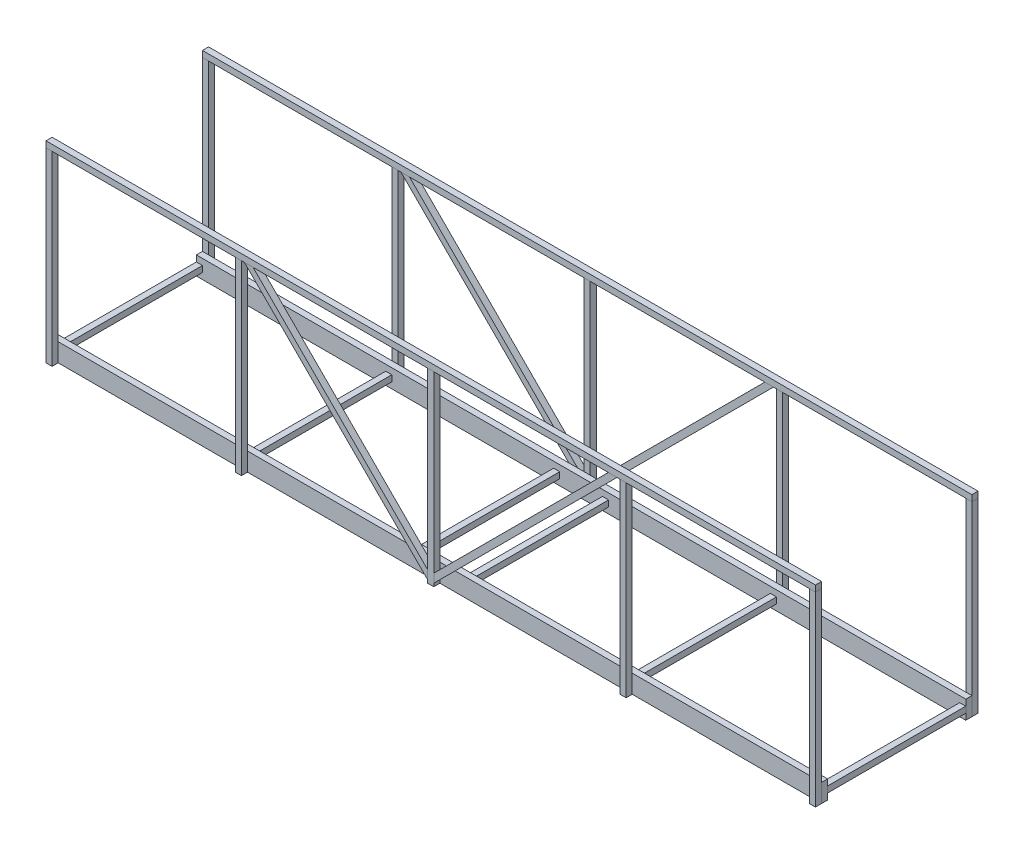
from build123d import *

# Parameters (mm, degrees)
SKETCH12_W                       = 3.175
SKETCH12_H                       = 9.525
STRUCTURAL_MEMBER1_DEPTH         = 400
SKETCH12_ON_SEGMENT_2_W          = 3.175
SKETCH12_ON_SEGMENT_2_H          = 9.525
STRUCTURAL_MEMBER1_2_DEPTH       = 400
SKETCH14_W                       = 3.175
SKETCH14_H                       = 3.175
STRUCTURAL_MEMBER2_DEPTH         = 75
SKETCH15_W                       = 3.175
SKETCH15_H                       = 3.175
STRUCTURAL_MEMBER3_DEPTH         = 75
SKETCH16_W                       = 3.175
SKETCH16_H                       = 3.175
STRUCTURAL_MEMBER4_DEPTH         = 75
SKETCH16_ON_SEGMENT_2_W          = 3.175
SKETCH16_ON_SEGMENT_2_H          = 3.175
STRUCTURAL_MEMBER4_2_DEPTH       = 75
SKETCH16_ON_SEGMENT_3_W          = 3.175
SKETCH16_ON_SEGMENT_3_H          = 3.175
STRUCTURAL_MEMBER4_3_DEPTH       = 75
SKETCH16_ON_SEGMENT_4_W          = 3.175
SKETCH16_ON_SEGMENT_4_H          = 3.175
STRUCTURAL_MEMBER4_4_DEPTH       = 75
SKETCH17_W                       = 3.175
SKETCH17_H                       = 3.175
STRUCTURAL_MEMBER5_DEPTH         = 100
SKETCH19_W                       = 3.175
SKETCH19_H                       = 3.175
STRUCTURAL_MEMBER6_DEPTH         = 100
SKETCH110_W                      = 3.175
SKETCH110_H                      = 3.175
STRUCTURAL_MEMBER7_DEPTH         = 100
SKETCH110_ON_SEGMENT_2_W         = 3.175
SKETCH110_ON_SEGMENT_2_H         = 3.175
STRUCTURAL_MEMBER7_2_DEPTH       = 100
SKETCH110_ON_SEGMENT_3_W         = 3.175
SKETCH110_ON_SEGMENT_3_H         = 3.175
STRUCTURAL_MEMBER7_3_DEPTH       = 100
SKETCH111_W                      = 3.175
SKETCH111_H                      = 3.175
STRUCTURAL_MEMBER8_DEPTH         = 400
SKETCH125_W                      = 3.175
SKETCH125_H                      = 3.175
STRUCTURAL_MEMBER15_DEPTH        = 100
SKETCH126_W                      = 3.175
SKETCH126_H                      = 3.175
STRUCTURAL_MEMBER16_DEPTH        = 100
SKETCH127_W                      = 3.175
SKETCH127_H                      = 3.175
STRUCTURAL_MEMBER17_DEPTH        = 100
SKETCH127_ON_SEGMENT_2_W         = 3.175
SKETCH127_ON_SEGMENT_2_H         = 3.175
STRUCTURAL_MEMBER17_2_DEPTH      = 100
SKETCH127_ON_SEGMENT_3_W         = 3.175
SKETCH127_ON_SEGMENT_3_H         = 3.175
STRUCTURAL_MEMBER17_3_DEPTH      = 100
SKETCH128_W                      = 3.175
SKETCH128_H                      = 3.175
STRUCTURAL_MEMBER18_DEPTH        = 400
SKETCH113_ON_SEGMENT_1_W         = 3.175
SKETCH113_ON_SEGMENT_1_H         = 3.175
STRUCTURAL_MEMBER9_DEPTH         = 142.421356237
SKETCH113_W                      = 3.175
SKETCH113_H                      = 3.175
STRUCTURAL_MEMBER9_2_DEPTH       = 141.421356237
BODY_START                       = 138.246356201
BODY_21_RUN_ON_DEPTH             = 76.130742
SKETCH130_ON_SEGMENT_1_W         = 3.175
SKETCH130_ON_SEGMENT_1_H         = 3.175
STRUCTURAL_MEMBER19_DEPTH        = 146.911484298
STRUCTURAL_MEMBER19_2_DEPTH      = 141.421356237
STRUCTURAL_MEMBER19_2_DEPTH_BACK = 5.490128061
SKETCH130_W                      = 3.175
SKETCH130_H                      = 3.175


with BuildPart() as part:
    # Sketch12 → Structural Member1 (new body)
    with BuildSketch(Plane(origin=(-200, 0, 37.5), x_dir=(0, 0, -1), z_dir=(1, 0, 0))):
        Rectangle(SKETCH12_W, SKETCH12_H)
    extrude(amount=STRUCTURAL_MEMBER1_DEPTH)


with BuildPart() as body_2:
    # Sketch12 on segment 2 (on carried to segment 2) → Structural Member1 2 (new body)
    with BuildSketch(Plane(origin=(-200, 0, -37.5), x_dir=(0, 0, -1), z_dir=(1, 0, 0))):
        Rectangle(SKETCH12_ON_SEGMENT_2_W, SKETCH12_ON_SEGMENT_2_H)
    extrude(amount=STRUCTURAL_MEMBER1_2_DEPTH)


with BuildPart() as body_3:
    # Sketch14 → Structural Member2 (new body)
    with BuildSketch(Plane(origin=(198.4125, 0, 37.5), x_dir=(-1, 0, 0), z_dir=(0, 0, -1))):
        Rectangle(SKETCH14_W, SKETCH14_H)
    extrude(amount=STRUCTURAL_MEMBER2_DEPTH)

    # Trim_Extend1 17: cut part
    add(part.part, mode=Mode.SUBTRACT)

    # Trim_Extend1 20
    split(bisect_by=Plane(origin=(0, 0, -35.9125), x_dir=(0, -1, 0), z_dir=(0, 0, 1)), keep=Keep.TOP)


with BuildPart() as body_4:
    # Sketch15 → Structural Member3 (new body)
    with BuildSketch(Plane(origin=(-198.4125, 0, 37.5), x_dir=(-1, 0, 0), z_dir=(0, 0, -1))):
        Rectangle(SKETCH15_W, SKETCH15_H)
    extrude(amount=STRUCTURAL_MEMBER3_DEPTH)

    # Trim_Extend1 17: cut part
    add(part.part, mode=Mode.SUBTRACT)

    # Trim_Extend1 34: cut body 2
    add(body_2.part, mode=Mode.SUBTRACT)


with BuildPart() as body_5:
    # Sketch16 → Structural Member4 (new body)
    with BuildSketch(Plane(origin=(-100, 0, -37.5), x_dir=(1, 0, 0), z_dir=(0, 0, 1))):
        Rectangle(SKETCH16_W, SKETCH16_H)
    extrude(amount=STRUCTURAL_MEMBER4_DEPTH)

    # Trim_Extend1
    split(bisect_by=Plane.YX.offset(-35.9125), keep=Keep.TOP)

    # Trim_Extend1 20
    split(bisect_by=Plane(origin=(0, 0, -35.9125), x_dir=(0, -1, 0), z_dir=(0, 0, 1)), keep=Keep.TOP)


with BuildPart() as body_6:
    # Sketch16 on segment 2 (on carried to segment 2) → Structural Member4 2 (new body)
    with BuildSketch(Plane(origin=(-12.7, 0, -37.5), x_dir=(1, 0, 0), z_dir=(0, 0, 1))):
        Rectangle(SKETCH16_ON_SEGMENT_2_W, SKETCH16_ON_SEGMENT_2_H)
    extrude(amount=STRUCTURAL_MEMBER4_2_DEPTH)

    # Trim_Extend1 17: cut part
    add(part.part, mode=Mode.SUBTRACT)

    # Trim_Extend1 34: cut body 2
    add(body_2.part, mode=Mode.SUBTRACT)


with BuildPart() as body_7:
    # Sketch16 on segment 3 (on carried to segment 3) → Structural Member4 3 (new body)
    with BuildSketch(Plane(origin=(12.7, 0, -37.5), x_dir=(1, 0, 0), z_dir=(0, 0, 1))):
        Rectangle(SKETCH16_ON_SEGMENT_3_W, SKETCH16_ON_SEGMENT_3_H)
    extrude(amount=STRUCTURAL_MEMBER4_3_DEPTH)

    # Trim_Extend1 17: cut part
    add(part.part, mode=Mode.SUBTRACT)

    # Trim_Extend1 34: cut body 2
    add(body_2.part, mode=Mode.SUBTRACT)


with BuildPart() as body_8:
    # Sketch16 on segment 4 (on carried to segment 4) → Structural Member4 4 (new body)
    with BuildSketch(Plane(origin=(100, 0, -37.5), x_dir=(1, 0, 0), z_dir=(0, 0, 1))):
        Rectangle(SKETCH16_ON_SEGMENT_4_W, SKETCH16_ON_SEGMENT_4_H)
    extrude(amount=STRUCTURAL_MEMBER4_4_DEPTH)

    # Trim_Extend1
    split(bisect_by=Plane.YX.offset(-35.9125), keep=Keep.TOP)

    # Trim_Extend1 20
    split(bisect_by=Plane(origin=(0, 0, -35.9125), x_dir=(0, -1, 0), z_dir=(0, 0, 1)), keep=Keep.TOP)


with BuildPart() as body_9:
    # Sketch17 → Structural Member5 (new body)
    with BuildSketch(Plane(origin=(-198.4125, -4.7625, 40.675), x_dir=(-1, 0, 0), z_dir=(0, 1, 0))):
        Rectangle(SKETCH17_W, SKETCH17_H)
    extrude(amount=STRUCTURAL_MEMBER5_DEPTH)


with BuildPart() as body_10:
    # Sketch19 → Structural Member6 (new body)
    with BuildSketch(Plane(origin=(198.4125, -4.7625, 40.675), x_dir=(-1, 0, 0), z_dir=(0, 1, 0))):
        Rectangle(SKETCH19_W, SKETCH19_H)
    extrude(amount=STRUCTURAL_MEMBER6_DEPTH)


with BuildPart() as body_11:
    # Sketch110 → Structural Member7 (new body)
    with BuildSketch(Plane(origin=(100, 95.2375, 40.675), x_dir=(1, 0, 0), z_dir=(0, -1, 0))):
        Rectangle(SKETCH110_W, SKETCH110_H)
    extrude(amount=STRUCTURAL_MEMBER7_DEPTH)

    # Trim_Extend2 7
    split(bisect_by=Plane(origin=(0, 92.0625, 40.675), x_dir=(1, 0, 0), z_dir=(0, -1, 0)), keep=Keep.TOP)


with BuildPart() as body_12:
    # Sketch110 on segment 2 (on carried to segment 2) → Structural Member7 2 (new body)
    with BuildSketch(Plane(origin=(0, 95.2375, 40.675), x_dir=(1, 0, 0), z_dir=(0, -1, 0))):
        Rectangle(SKETCH110_ON_SEGMENT_2_W, SKETCH110_ON_SEGMENT_2_H)
    extrude(amount=STRUCTURAL_MEMBER7_2_DEPTH)

    # Trim_Extend2 7
    split(bisect_by=Plane(origin=(0, 92.0625, 40.675), x_dir=(1, 0, 0), z_dir=(0, -1, 0)), keep=Keep.TOP)


with BuildPart() as body_13:
    # Sketch110 on segment 3 (on carried to segment 3) → Structural Member7 3 (new body)
    with BuildSketch(Plane(origin=(-100, 95.2375, 40.675), x_dir=(1, 0, 0), z_dir=(0, -1, 0))):
        Rectangle(SKETCH110_ON_SEGMENT_3_W, SKETCH110_ON_SEGMENT_3_H)
    extrude(amount=STRUCTURAL_MEMBER7_3_DEPTH)


with BuildPart() as body_14:
    # Sketch111 → Structural Member8 (new body)
    with BuildSketch(Plane(origin=(-200, 93.65, 40.675), x_dir=(0, 1, 0), z_dir=(1, 0, 0))):
        Rectangle(SKETCH111_W, SKETCH111_H)
    extrude(amount=STRUCTURAL_MEMBER8_DEPTH)


with BuildPart() as body_9_1:
    add(body_9.part)

    # Trim_Extend2 17: cut body 14
    add(body_14.part, mode=Mode.SUBTRACT)


with BuildPart() as body_13_1:
    add(body_13.part)

    # Trim_Extend2 17: cut body 14
    add(body_14.part, mode=Mode.SUBTRACT)


with BuildPart() as body_10_1:
    add(body_10.part)

    # Trim_Extend2 17: cut body 14
    add(body_14.part, mode=Mode.SUBTRACT)


with BuildPart() as body_15:
    # Sketch125 → Structural Member15 (new body)
    with BuildSketch(Plane(origin=(198.4125, -4.7625, -40.675), x_dir=(1, 0, 0), z_dir=(0, 1, 0))):
        Rectangle(SKETCH125_W, SKETCH125_H)
    extrude(amount=STRUCTURAL_MEMBER15_DEPTH)

    # Trim_Extend3 5
    split(bisect_by=Plane(origin=(0, 92.0625, -40.675), x_dir=(1, 0, 0), z_dir=(0, -1, 0)), keep=Keep.TOP)


with BuildPart() as body_16:
    # Sketch126 → Structural Member16 (new body)
    with BuildSketch(Plane(origin=(-198.4125, -4.7625, -40.675), x_dir=(1, 0, 0), z_dir=(0, 1, 0))):
        Rectangle(SKETCH126_W, SKETCH126_H)
    extrude(amount=STRUCTURAL_MEMBER16_DEPTH)


with BuildPart() as body_17:
    # Sketch127 → Structural Member17 (new body)
    with BuildSketch(Plane(origin=(100, -4.7625, -40.675), x_dir=(1, 0, 0), z_dir=(0, 1, 0))):
        Rectangle(SKETCH127_W, SKETCH127_H)
    extrude(amount=STRUCTURAL_MEMBER17_DEPTH)


with BuildPart() as body_18:
    # Sketch127 on segment 2 (on carried to segment 2) → Structural Member17 2 (new body)
    with BuildSketch(Plane(origin=(0, -4.7625, -40.675), x_dir=(1, 0, 0), z_dir=(0, 1, 0))):
        Rectangle(SKETCH127_ON_SEGMENT_2_W, SKETCH127_ON_SEGMENT_2_H)
    extrude(amount=STRUCTURAL_MEMBER17_2_DEPTH)

    # Trim_Extend3 5
    split(bisect_by=Plane(origin=(0, 92.0625, -40.675), x_dir=(1, 0, 0), z_dir=(0, -1, 0)), keep=Keep.TOP)


with BuildPart() as body_19:
    # Sketch127 on segment 3 (on carried to segment 3) → Structural Member17 3 (new body)
    with BuildSketch(Plane(origin=(-100, -4.7625, -40.675), x_dir=(1, 0, 0), z_dir=(0, 1, 0))):
        Rectangle(SKETCH127_ON_SEGMENT_3_W, SKETCH127_ON_SEGMENT_3_H)
    extrude(amount=STRUCTURAL_MEMBER17_3_DEPTH)

    # Trim_Extend3 5
    split(bisect_by=Plane(origin=(0, 92.0625, -40.675), x_dir=(1, 0, 0), z_dir=(0, -1, 0)), keep=Keep.TOP)


with BuildPart() as body_20:
    # Sketch128 → Structural Member18 (new body)
    with BuildSketch(Plane(origin=(-200, 93.65, -40.675), x_dir=(0, -1, 0), z_dir=(1, 0, 0))):
        Rectangle(SKETCH128_W, SKETCH128_H)
    extrude(amount=STRUCTURAL_MEMBER18_DEPTH)


with BuildPart() as body_17_1:
    add(body_17.part)

    # Trim_Extend3 17: cut body 20
    add(body_20.part, mode=Mode.SUBTRACT)


with BuildPart() as body_16_1:
    add(body_16.part)

    # Trim_Extend3 17: cut body 20
    add(body_20.part, mode=Mode.SUBTRACT)


with BuildPart() as body_21:
    # Sketch113 on segment 1 (on carried to segment 1) → Structural Member9 (new body)
    with BuildSketch(Plane(origin=(-98.877467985, 96.360032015, 40.675), x_dir=(0.707106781, 0.707106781, 0), z_dir=(0.707106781, -0.707106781, 0))):
        Rectangle(SKETCH113_ON_SEGMENT_1_W, SKETCH113_ON_SEGMENT_1_H)
    extrude(amount=STRUCTURAL_MEMBER9_DEPTH)

    # Structural Member9 end butt 1
    split(bisect_by=Plane(origin=(-2.24506403, -2.51743597, 39.0875), x_dir=(-0.707106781, -0.707106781, 0), z_dir=(-0.707106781, 0.707106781, 0)), keep=Keep.TOP)

    # Sketch113 on segment 1 (on carried to segment 1) → body 21 run on (add)
    with BuildSketch(Plane(origin=(-98.877467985, 96.360032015, 40.675), x_dir=(0.707106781, 0.707106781, 0), z_dir=(0.707106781, -0.707106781, 0)).offset(BODY_START)):
        Rectangle(SKETCH113_ON_SEGMENT_1_W, SKETCH113_ON_SEGMENT_1_H)
    extrude(amount=BODY_21_RUN_ON_DEPTH)

    # Trim_Extend6 7
    split(bisect_by=Plane(origin=(0, 92.0625, 40.675), x_dir=(1, 0, 0), z_dir=(0, -1, 0)), keep=Keep.TOP)

    # Trim_Extend6 24
    split(bisect_by=Plane(origin=(-1.5875, 43.65, 40.675), x_dir=(0, -1, 0), z_dir=(-1, 0, 0)), keep=Keep.TOP)


with BuildPart() as body_22:
    # Sketch113 → Structural Member9 2 (new body)
    with BuildSketch(Plane(origin=(-1.122532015, -3.639967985, 40.675), x_dir=(-0.707106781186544, 0.7071067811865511, 0), z_dir=(0.7071067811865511, 0.707106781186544, 0))):
        Rectangle(SKETCH113_W, SKETCH113_H)
    extrude(amount=STRUCTURAL_MEMBER9_2_DEPTH)

    # Trim_Extend6 7
    split(bisect_by=Plane(origin=(0, 92.0625, 40.675), x_dir=(1, 0, 0), z_dir=(0, -1, 0)), keep=Keep.TOP)

    # Trim_Extend6 22
    split(bisect_by=Plane(origin=(1.5875, 43.65, 40.675), x_dir=(0, 1, 0), z_dir=(1, 0, 0)), keep=Keep.TOP)


with BuildPart() as body_23:
    # Sketch130 on segment 1 (on carried to segment 1) → Structural Member19 (new body)
    with BuildSketch(Plane(origin=(-98.877467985, 96.360032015, -40.675), x_dir=(-0.707106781, -0.707106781, 0), z_dir=(0.707106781, -0.707106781, 0))):
        Rectangle(SKETCH130_ON_SEGMENT_1_W, SKETCH130_ON_SEGMENT_1_H)
    extrude(amount=STRUCTURAL_MEMBER19_DEPTH)

    # Structural Member19 mitre 1
    split(bisect_by=Plane(origin=(0, -4.7625, -39.0875), x_dir=(0, -1, 0), z_dir=(-1, 0, 0)), keep=Keep.TOP)

    # Trim_Extend17 5
    split(bisect_by=Plane(origin=(0, 92.0625, -40.675), x_dir=(1, 0, 0), z_dir=(0, -1, 0)), keep=Keep.TOP)

    # Trim_Extend17 24
    split(bisect_by=Plane(origin=(-1.5875, 43.65, -40.675), x_dir=(0, -1, 0), z_dir=(-1, 0, 0)), keep=Keep.TOP)


with BuildPart() as body_24:
    # Sketch130 → Structural Member19 2 (new, two sides: drawn at the far end of the back side and taken through both)
    with BuildSketch(Plane(origin=(-1.122532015, -3.639967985, -40.675), x_dir=(0.7071067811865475, -0.7071067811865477, 0), z_dir=(0.7071067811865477, 0.7071067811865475, 0)).offset(-STRUCTURAL_MEMBER19_2_DEPTH_BACK)):
        Rectangle(SKETCH130_W, SKETCH130_H)
    extrude(amount=STRUCTURAL_MEMBER19_2_DEPTH + STRUCTURAL_MEMBER19_2_DEPTH_BACK)

    # Structural Member19 2 mitre 1
    split(bisect_by=Plane(origin=(0, -4.7625, -39.0875), x_dir=(0, 1, 0), z_dir=(1, 0, 0)), keep=Keep.TOP)

    # Trim_Extend17 5
    split(bisect_by=Plane(origin=(0, 92.0625, -40.675), x_dir=(1, 0, 0), z_dir=(0, -1, 0)), keep=Keep.TOP)

    # Trim_Extend17 34: cut body 18
    add(body_18.part, mode=Mode.SUBTRACT)


solid = Compound([part.part, body_2.part, body_3.part, body_4.part, body_5.part, body_6.part, body_7.part, body_8.part, body_11.part, body_12.part, body_14.part, body_9_1.part, body_13_1.part, body_10_1.part, body_15.part, body_18.part, body_19.part, body_20.part, body_17_1.part, body_16_1.part, body_21.part, body_22.part, body_23.part, body_24.part])
